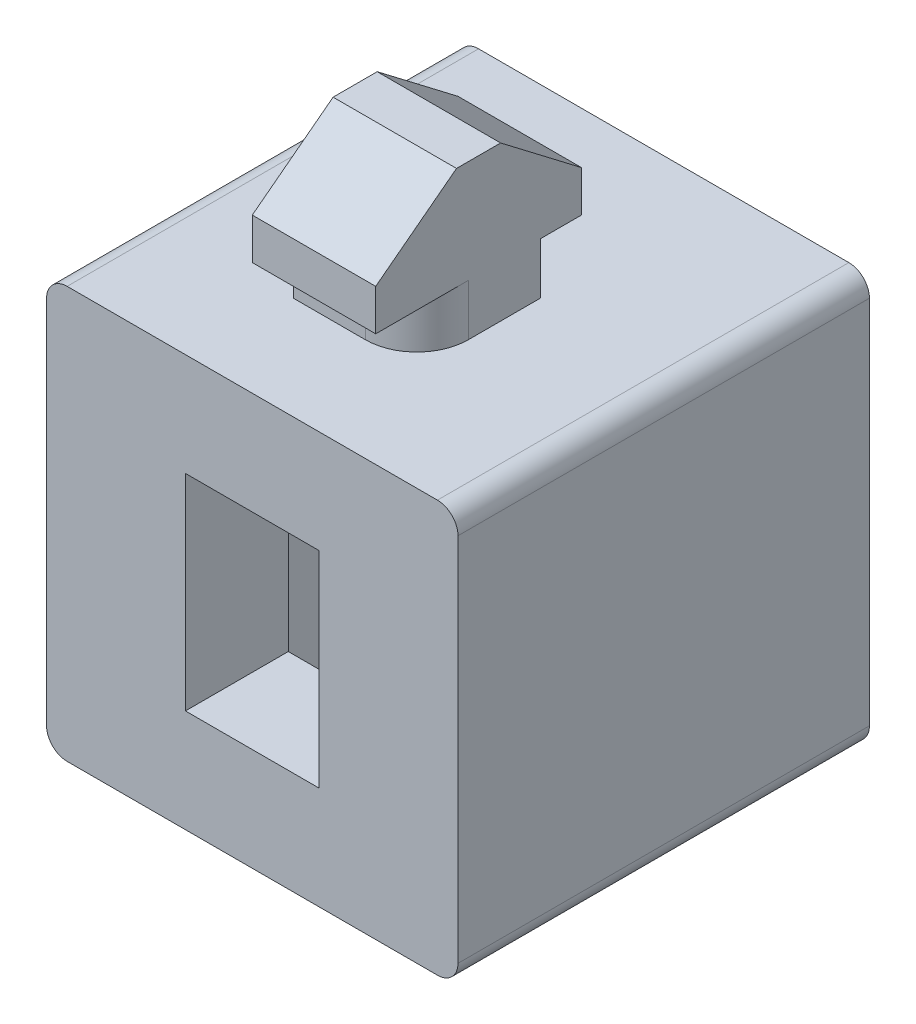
from build123d import *

# Parameters (mm, degrees)
SKETCH_1_W          = 20
SKETCH_1_H          = 20
SKETCH_1_W_2        = 6.5
SKETCH_1_H_2        = 10
EXTRUDE_1_DEPTH     = 10
SKETCH_2_W          = 10
SKETCH_2_H          = 5
CUT_EXTRUDE_1_DEPTH = 17
SKETCH_3_W          = 6
SKETCH_3_H          = 6
EXTRUDE_2_DEPTH     = 2.5
FILLET_1_R          = 2.5
EXTRUDE_3_DEPTH     = 3
FILLET_2_R          = 1


with BuildPart() as part:
    # Sketch 1 → Extrude 1 (new, symmetric)
    with BuildSketch(Plane.XY):
        Rectangle(SKETCH_1_W, SKETCH_1_H)
        Rectangle(SKETCH_1_W_2, SKETCH_1_H_2, mode=Mode.SUBTRACT)
    extrude(amount=EXTRUDE_1_DEPTH, both=True)

    # Sketch 2 → Cut-Extrude 1 (cut)
    with BuildSketch(Plane.XZ.offset(10)):
        with Locations((0, 2.5)):
            Rectangle(SKETCH_2_W, SKETCH_2_H)
    extrude(amount=-CUT_EXTRUDE_1_DEPTH, mode=Mode.SUBTRACT)

    # Sketch 3 → Extrude 2 (add)
    with BuildSketch(Plane(origin=(0, 10, 0), x_dir=(1, 0, 0), z_dir=(0, 1, 0))):
        with Locations((0, -2)):
            Rectangle(SKETCH_3_W, SKETCH_3_H)
    extrude(amount=EXTRUDE_2_DEPTH)

    # Fillet 1
    fillet_1_edges = [part.edges().sort_by_distance(p)[0] for p in [
        (-3, 11.25, -1),
        (3, 11.25, 5),
    ]]
    fillet(fillet_1_edges, radius=FILLET_1_R)

    # Sketch 4 → Extrude 3 (add, symmetric)
    with BuildSketch(Plane(origin=(0, 0, 0), x_dir=(0, 0, -1), z_dir=(1, 0, 0))):
        Polygon((-2, 12.5), (3, 12.5), (3, 14.5), (-0.92831871, 17.5), (-2, 17.5), align=None)
    extrude_3 = extrude(amount=EXTRUDE_3_DEPTH, both=True)

    # Mirror 1: Extrude 3 across plane
    add(extrude_3.mirror(Plane(origin=(3, 12.5, 2), x_dir=(1, 0, 0), z_dir=(0, 0, -1))))

    # Fillet 2
    fillet_2_edges = [part.edges().sort_by_distance(p)[0] for p in [
        (-10, 10, 0),
        (10, 10, 0),
        (10, -10, 0),
        (-10, -10, 0),
    ]]
    fillet(fillet_2_edges, radius=FILLET_2_R)


solid = part.part
